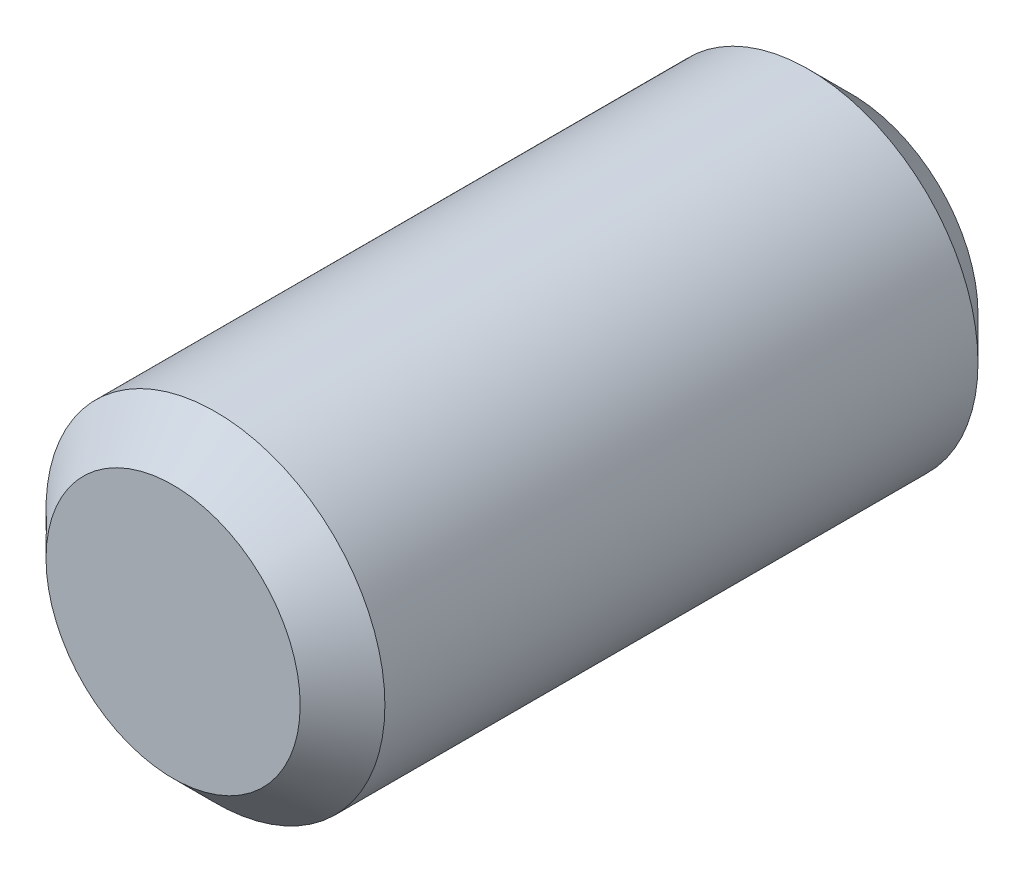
from build123d import *

# Parameters (mm, degrees)
ESQUISSE1_R        = 2
BOSS_EXTRU_1_DEPTH = 4
CHANFREIN1_SIZE    = 0.5


with BuildPart() as part:
    # Esquisse1 → Boss.-Extru.1 (new, symmetric)
    with BuildSketch(Plane.XY):
        Circle(ESQUISSE1_R)
    extrude(amount=BOSS_EXTRU_1_DEPTH, both=True)

    # Chanfrein1
    chanfrein1_edges = [part.edges().sort_by_distance(p)[0] for p in [
        (-2, 0, -4),
        (-2, 0, 4),
    ]]
    chamfer(chanfrein1_edges, length=CHANFREIN1_SIZE)


solid = part.part
